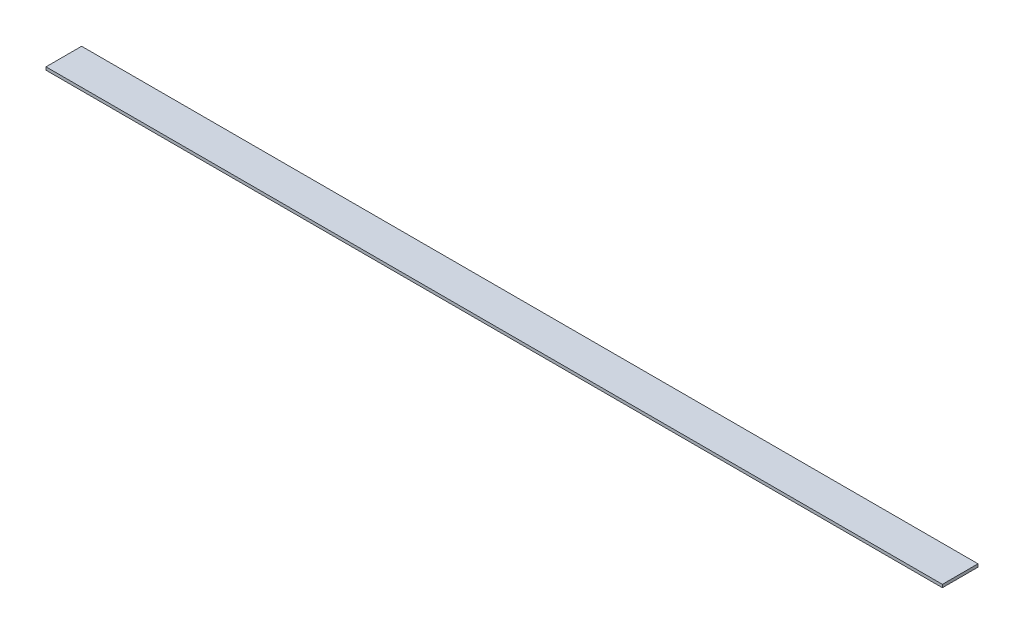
ISO-10303-21;
HEADER;
FILE_DESCRIPTION(('STEP AP214'),'2;1');
FILE_NAME('part.step','',(''),(''),'','','');
FILE_SCHEMA(('AUTOMOTIVE_DESIGN { 1 0 10303 214 1 1 1 1 }'));
ENDSEC;
DATA;
#1=APPLICATION_CONTEXT('core data for automotive mechanical design processes');
#2=APPLICATION_PROTOCOL_DEFINITION('international standard','automotive_design',2000,#1);
#3=PRODUCT_CONTEXT('',#1,'mechanical');
#4=PRODUCT('Part','Part','',(#3));
#5=PRODUCT_RELATED_PRODUCT_CATEGORY('part','',(#4));
#6=PRODUCT_DEFINITION_FORMATION('','',#4);
#7=PRODUCT_DEFINITION_CONTEXT('part definition',#1,'design');
#8=PRODUCT_DEFINITION('design','',#6,#7);
#9=PRODUCT_DEFINITION_SHAPE('','',#8);
#10=(LENGTH_UNIT() NAMED_UNIT(*) SI_UNIT(.MILLI.,.METRE.));
#11=(NAMED_UNIT(*) PLANE_ANGLE_UNIT() SI_UNIT($,.RADIAN.));
#12=(NAMED_UNIT(*) SI_UNIT($,.STERADIAN.) SOLID_ANGLE_UNIT());
#13=UNCERTAINTY_MEASURE_WITH_UNIT(LENGTH_MEASURE(1.E-05),#10,'distance_accuracy_value','');
#14=(GEOMETRIC_REPRESENTATION_CONTEXT(3) GLOBAL_UNCERTAINTY_ASSIGNED_CONTEXT((#13)) GLOBAL_UNIT_ASSIGNED_CONTEXT((#10,
#11,#12)) REPRESENTATION_CONTEXT('',''));
#15=CARTESIAN_POINT('',(0.,0.,0.));
#16=DIRECTION('',(0.,0.,1.));
#17=DIRECTION('',(1.,0.,0.));
#18=AXIS2_PLACEMENT_3D('',#15,#16,#17);
#19=CARTESIAN_POINT('',(-75.5,0.500000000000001,-2.99999999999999));
#20=DIRECTION('',(0.,0.,-1.));
#21=DIRECTION('',(0.,1.,0.));
#22=AXIS2_PLACEMENT_3D('',#19,#20,#21);
#23=PLANE('',#22);
#24=DIRECTION('',(1.,0.,0.));
#25=VECTOR('',#24,1.);
#26=CARTESIAN_POINT('',(-75.5,0.,-2.99999999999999));
#27=LINE('',#26,#25);
#28=CARTESIAN_POINT('',(-75.5,0.,-2.99999999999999));
#29=VERTEX_POINT('',#28);
#30=CARTESIAN_POINT('',(75.5,0.,-2.99999999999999));
#31=VERTEX_POINT('',#30);
#32=EDGE_CURVE('E99',#29,#31,#27,.T.);
#33=ORIENTED_EDGE('',*,*,#32,.F.);
#34=DIRECTION('',(0.,-1.,0.));
#35=VECTOR('',#34,1.);
#36=CARTESIAN_POINT('',(-75.5,0.500000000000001,-2.99999999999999));
#37=LINE('',#36,#35);
#38=CARTESIAN_POINT('',(-75.5,0.500000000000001,-2.99999999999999));
#39=VERTEX_POINT('',#38);
#40=EDGE_CURVE('E11',#39,#29,#37,.T.);
#41=ORIENTED_EDGE('',*,*,#40,.F.);
#42=DIRECTION('',(1.,0.,0.));
#43=VECTOR('',#42,1.);
#44=CARTESIAN_POINT('',(-75.5,0.500000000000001,-2.99999999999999));
#45=LINE('',#44,#43);
#46=CARTESIAN_POINT('',(75.5,0.500000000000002,-2.99999999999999));
#47=VERTEX_POINT('',#46);
#48=EDGE_CURVE('E93',#39,#47,#45,.T.);
#49=ORIENTED_EDGE('',*,*,#48,.T.);
#50=DIRECTION('',(0.,-1.,0.));
#51=VECTOR('',#50,1.);
#52=CARTESIAN_POINT('',(75.5,0.500000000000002,-2.99999999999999));
#53=LINE('',#52,#51);
#54=EDGE_CURVE('E38',#47,#31,#53,.T.);
#55=ORIENTED_EDGE('',*,*,#54,.T.);
#56=EDGE_LOOP('',(#33,#41,#49,#55));
#57=FACE_BOUND('',#56,.T.);
#58=ADVANCED_FACE('F35',(#57),#23,.T.);
#59=CARTESIAN_POINT('',(-75.5,0.500000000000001,3.));
#60=DIRECTION('',(-1.,0.,0.));
#61=DIRECTION('',(0.,-1.,0.));
#62=AXIS2_PLACEMENT_3D('',#59,#60,#61);
#63=PLANE('',#62);
#64=DIRECTION('',(0.,0.,-1.));
#65=VECTOR('',#64,1.);
#66=CARTESIAN_POINT('',(-75.5,0.,3.));
#67=LINE('',#66,#65);
#68=CARTESIAN_POINT('',(-75.5,0.,3.));
#69=VERTEX_POINT('',#68);
#70=EDGE_CURVE('E95',#69,#29,#67,.T.);
#71=ORIENTED_EDGE('',*,*,#70,.F.);
#72=DIRECTION('',(0.,-1.,0.));
#73=VECTOR('',#72,1.);
#74=CARTESIAN_POINT('',(-75.5,0.500000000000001,3.));
#75=LINE('',#74,#73);
#76=CARTESIAN_POINT('',(-75.5,0.500000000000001,3.));
#77=VERTEX_POINT('',#76);
#78=EDGE_CURVE('E44',#77,#69,#75,.T.);
#79=ORIENTED_EDGE('',*,*,#78,.F.);
#80=DIRECTION('',(0.,0.,-1.));
#81=VECTOR('',#80,1.);
#82=CARTESIAN_POINT('',(-75.5,0.500000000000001,3.));
#83=LINE('',#82,#81);
#84=EDGE_CURVE('E90',#77,#39,#83,.T.);
#85=ORIENTED_EDGE('',*,*,#84,.T.);
#86=ORIENTED_EDGE('',*,*,#40,.T.);
#87=EDGE_LOOP('',(#71,#79,#85,#86));
#88=FACE_BOUND('',#87,.T.);
#89=ADVANCED_FACE('F109',(#88),#63,.T.);
#90=CARTESIAN_POINT('',(75.5,0.500000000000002,3.));
#91=DIRECTION('',(0.,0.,1.));
#92=DIRECTION('',(0.,-1.,0.));
#93=AXIS2_PLACEMENT_3D('',#90,#91,#92);
#94=PLANE('',#93);
#95=DIRECTION('',(-1.,0.,0.));
#96=VECTOR('',#95,1.);
#97=CARTESIAN_POINT('',(75.5,0.,3.));
#98=LINE('',#97,#96);
#99=CARTESIAN_POINT('',(75.5,0.,3.));
#100=VERTEX_POINT('',#99);
#101=EDGE_CURVE('E85',#100,#69,#98,.T.);
#102=ORIENTED_EDGE('',*,*,#101,.F.);
#103=DIRECTION('',(0.,-1.,0.));
#104=VECTOR('',#103,1.);
#105=CARTESIAN_POINT('',(75.5,0.500000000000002,3.));
#106=LINE('',#105,#104);
#107=CARTESIAN_POINT('',(75.5,0.500000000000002,3.));
#108=VERTEX_POINT('',#107);
#109=EDGE_CURVE('E80',#108,#100,#106,.T.);
#110=ORIENTED_EDGE('',*,*,#109,.F.);
#111=DIRECTION('',(-1.,0.,0.));
#112=VECTOR('',#111,1.);
#113=CARTESIAN_POINT('',(75.5,0.500000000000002,3.));
#114=LINE('',#113,#112);
#115=EDGE_CURVE('E83',#108,#77,#114,.T.);
#116=ORIENTED_EDGE('',*,*,#115,.T.);
#117=ORIENTED_EDGE('',*,*,#78,.T.);
#118=EDGE_LOOP('',(#102,#110,#116,#117));
#119=FACE_BOUND('',#118,.T.);
#120=ADVANCED_FACE('F82',(#119),#94,.T.);
#121=CARTESIAN_POINT('',(75.5,0.500000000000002,-2.99999999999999));
#122=DIRECTION('',(1.,0.,0.));
#123=DIRECTION('',(0.,1.,0.));
#124=AXIS2_PLACEMENT_3D('',#121,#122,#123);
#125=PLANE('',#124);
#126=DIRECTION('',(0.,0.,1.));
#127=VECTOR('',#126,1.);
#128=CARTESIAN_POINT('',(75.5,0.,-2.99999999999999));
#129=LINE('',#128,#127);
#130=EDGE_CURVE('E102',#31,#100,#129,.T.);
#131=ORIENTED_EDGE('',*,*,#130,.F.);
#132=ORIENTED_EDGE('',*,*,#54,.F.);
#133=DIRECTION('',(0.,0.,1.));
#134=VECTOR('',#133,1.);
#135=CARTESIAN_POINT('',(75.5,0.500000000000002,-2.99999999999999));
#136=LINE('',#135,#134);
#137=EDGE_CURVE('E89',#47,#108,#136,.T.);
#138=ORIENTED_EDGE('',*,*,#137,.T.);
#139=ORIENTED_EDGE('',*,*,#109,.T.);
#140=EDGE_LOOP('',(#131,#132,#138,#139));
#141=FACE_BOUND('',#140,.T.);
#142=ADVANCED_FACE('F92',(#141),#125,.T.);
#143=CARTESIAN_POINT('',(0.,0.500000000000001,0.));
#144=DIRECTION('',(0.,-1.,0.));
#145=DIRECTION('',(1.,0.,0.));
#146=AXIS2_PLACEMENT_3D('',#143,#144,#145);
#147=PLANE('',#146);
#148=ORIENTED_EDGE('',*,*,#48,.F.);
#149=ORIENTED_EDGE('',*,*,#84,.F.);
#150=ORIENTED_EDGE('',*,*,#115,.F.);
#151=ORIENTED_EDGE('',*,*,#137,.F.);
#152=EDGE_LOOP('',(#148,#149,#150,#151));
#153=FACE_BOUND('',#152,.T.);
#154=ADVANCED_FACE('F88',(#153),#147,.F.);
#155=CARTESIAN_POINT('',(0.,0.,0.));
#156=DIRECTION('',(0.,-1.,0.));
#157=DIRECTION('',(1.,0.,0.));
#158=AXIS2_PLACEMENT_3D('',#155,#156,#157);
#159=PLANE('',#158);
#160=ORIENTED_EDGE('',*,*,#32,.T.);
#161=ORIENTED_EDGE('',*,*,#130,.T.);
#162=ORIENTED_EDGE('',*,*,#101,.T.);
#163=ORIENTED_EDGE('',*,*,#70,.T.);
#164=EDGE_LOOP('',(#160,#161,#162,#163));
#165=FACE_BOUND('',#164,.T.);
#166=ADVANCED_FACE('F108',(#165),#159,.T.);
#167=CLOSED_SHELL('',(#58,#89,#120,#142,#154,#166));
#168=MANIFOLD_SOLID_BREP('B2',#167);
#169=ADVANCED_BREP_SHAPE_REPRESENTATION('',(#18,#168),#14);
#170=SHAPE_DEFINITION_REPRESENTATION(#9,#169);
ENDSEC;
END-ISO-10303-21;
